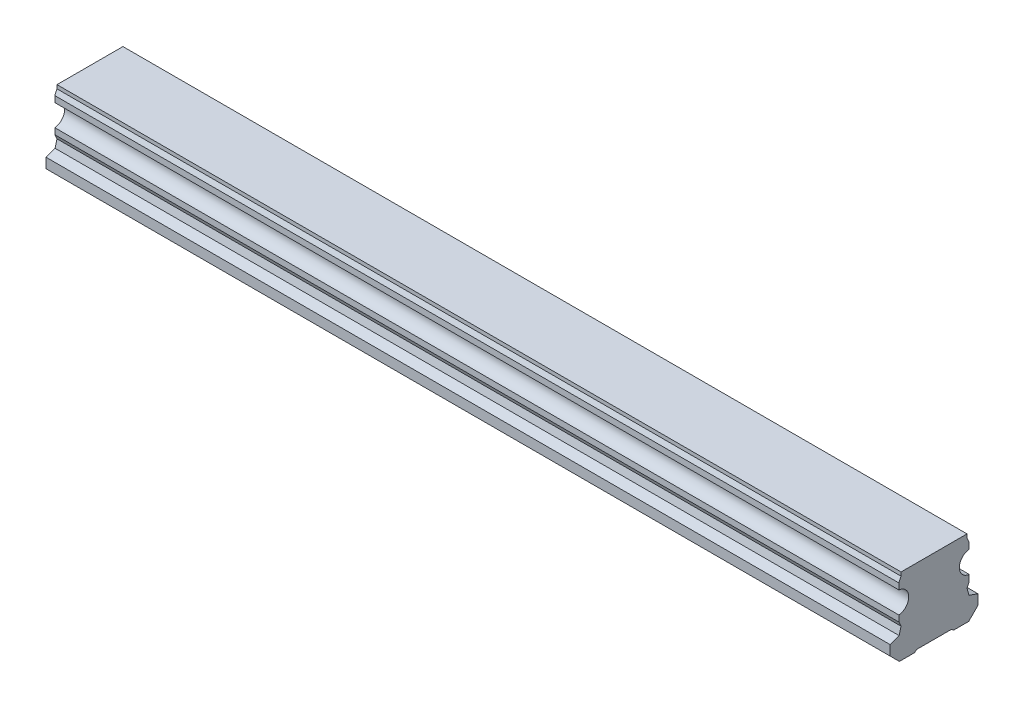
from build123d import *

# Parameters (mm, degrees)
BOSS_EXTRUDE1_DEPTH        = 240
SKETCH3_R                  = 3
SKETCH3_R_2                = 2.5
CUT_EXTRUDE3_DEPTH         = 12
SKETCH3_2_R                = 2.5
CUT_EXTRUDE4_DEPTH         = 15
CHAMFER1_SIZE              = 0.5
LPATTERN4_COUNT            = 4
LPATTERN4_PITCH            = 60
CHAMFER1_OF_LPATTERN4_SIZE = 0.5


with BuildPart() as part:
    # Sketch1 → Boss-Extrude1 (new body)
    with BuildSketch(Plane(origin=(0, 0, 0), x_dir=(0, 0, -1), z_dir=(1, 0, 0))):
        with BuildLine():
            Line((9.375, 21.8), (-9.375, 21.8))
            Line((-9.375, 21.8), (-9.375, 20.756))
            Line((-9.375, 20.756), (-10, 19.415683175))
            Line((-10, 19.415683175), (-10, 17.685449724))
            ThreePointArc((-10, 17.685449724), (-7.2, 14.6), (-10, 11.514550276))
            Line((-10, 11.514550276), (-10, 9.784316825))
            Line((-10, 9.784316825), (-9.375, 8.444))
            Line((-9.375, 8.444), (-9.922688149, 6.4))
            Line((-9.922688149, 6.4), (-12.5, 5.489338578))
            Line((-12.5, 5.489338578), (-12.5, 2.65))
            Line((-12.5, 2.65), (-9.85, 0))
            Line((-9.85, 0), (-5.5, 0))
            Line((-5.5, 0), (-5, 0.5))
            Line((-5, 0.5), (5, 0.5))
            Line((5, 0.5), (5.5, 0))
            Line((5.5, 0), (9.85, 0))
            Line((9.85, 0), (12.5, 2.65))
            Line((12.5, 2.65), (12.5, 5.489338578))
            Line((12.5, 5.489338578), (9.922688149, 6.4))
            Line((9.922688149, 6.4), (9.375, 8.444))
            Line((9.375, 8.444), (10, 9.784316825))
            Line((10, 9.784316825), (10, 11.514550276))
            ThreePointArc((10, 11.514550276), (7.2, 14.6), (10, 17.685449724))
            Line((10, 17.685449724), (10, 19.415683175))
            Line((10, 19.415683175), (9.375, 20.756))
            Line((9.375, 20.756), (9.375, 21.8))
        make_face()
    extrude(amount=BOSS_EXTRUDE1_DEPTH)

    # Sketch3 → Cut-Extrude3 (cut)
    with BuildSketch(Plane.XZ):
        with Locations(Location((30, 0, 0), (0, 0, 270))):
            Circle(SKETCH3_R)
        with Locations(Location((30, 0, 0), (0, 0, 270))):
            Circle(SKETCH3_R_2, mode=Mode.SUBTRACT)
    cut_extrude3 = extrude(amount=-CUT_EXTRUDE3_DEPTH, mode=Mode.SUBTRACT)

    # Sketch3_2 → Cut-Extrude4 (cut)
    with BuildSketch(Plane.XZ):
        with Locations(Location((30, 0, 0), (0, 0, 270))):
            Circle(SKETCH3_2_R)
    cut_extrude4 = extrude(amount=-CUT_EXTRUDE4_DEPTH, mode=Mode.SUBTRACT)

    # Cut-Extrude5 cone 1 section (on through the dimple's axis) → Cut-Extrude5 (revolve, cut)
    with BuildSketch(Plane(origin=(30, 15, 0), x_dir=(0, 0, -1), z_dir=(1, 0, 0))):
        Polygon((0, 0), (2.5, 0), (0, 1.443375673), align=None)
    cut_extrude5 = revolve(axis=Axis((30, 15, 0), (0, 1, 0)), mode=Mode.SUBTRACT)

    # Chamfer1
    chamfer1_edges = [part.edges().sort_by_distance(p)[0] for p in [
        (30, 0.5, 3),
    ]]
    chamfer(chamfer1_edges, length=CHAMFER1_SIZE)

    # LPattern4: Cut-Extrude3, Cut-Extrude4, Cut-Extrude5 ×4
    with Locations(*[(i * LPATTERN4_PITCH, 0, 0) for i in range(1, LPATTERN4_COUNT)]):
        add(cut_extrude3, mode=Mode.SUBTRACT)
        add(cut_extrude4, mode=Mode.SUBTRACT)
        add(cut_extrude5, mode=Mode.SUBTRACT)

    # Chamfer1 of LPattern4
    chamfer1_of_lpattern4_edges = [part.edges().sort_by_distance(p)[0] for p in [
        (90, 0.5, 3),
        (150, 0.5, 3),
        (210, 0.5, 3),
    ]]
    chamfer(chamfer1_of_lpattern4_edges, length=CHAMFER1_OF_LPATTERN4_SIZE)


solid = part.part
